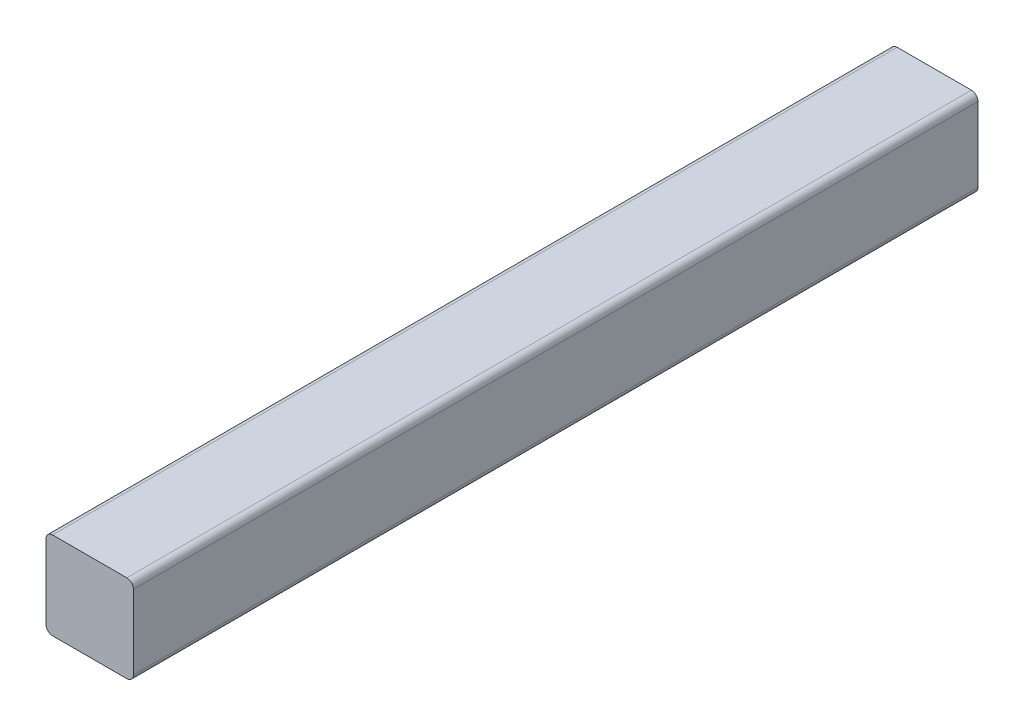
from build123d import *

# Parameters (mm, degrees)
EXTRUSION1_DEPTH = 290


with BuildPart() as part:
    # Esquisse1 → Extrusion1 (new body)
    with BuildSketch(Plane.XY):
        with BuildLine():
            Line((-15, 12.75), (-15, -12.75))
            ThreePointArc((-15, -12.75), (-14.340990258, -14.340990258), (-12.75, -15))
            Line((-12.75, -15), (12.75, -15))
            ThreePointArc((12.75, -15), (14.340990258, -14.340990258), (15, -12.75))
            Line((15, -12.75), (15, 12.75))
            ThreePointArc((15, 12.75), (14.340990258, 14.340990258), (12.75, 15))
            Line((12.75, 15), (-12.75, 15))
            ThreePointArc((-12.75, 15), (-14.340990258, 14.340990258), (-15, 12.75))
        make_face()
    extrude(amount=EXTRUSION1_DEPTH)


solid = part.part
